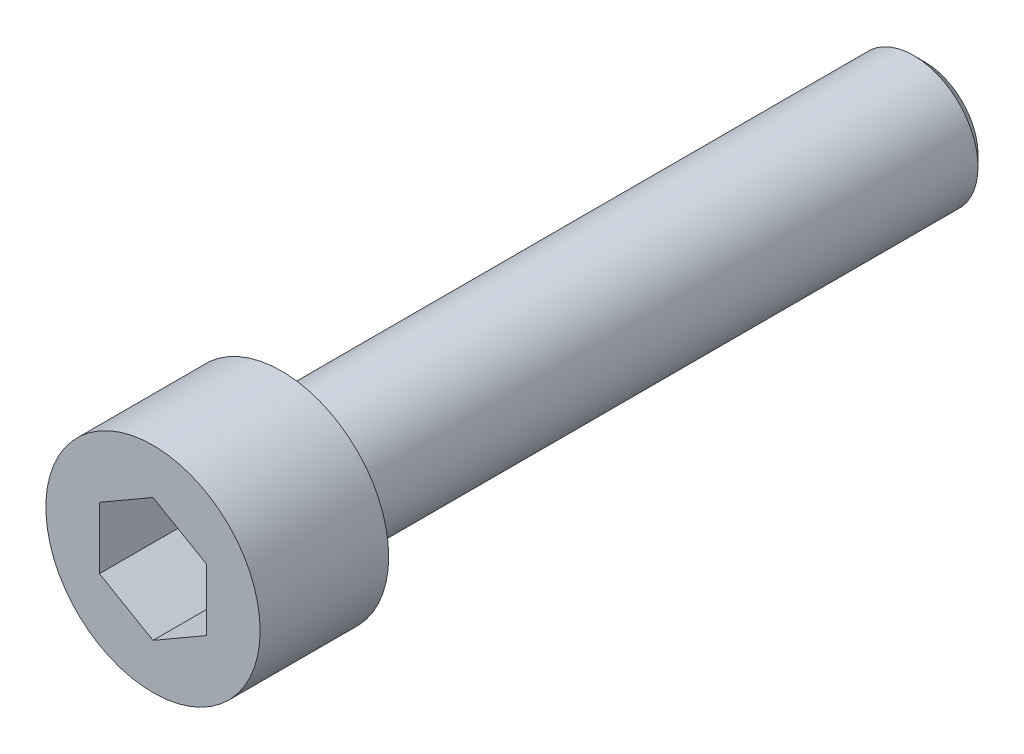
from build123d import *

# Parameters (mm, degrees)
SKETCH1_R           = 5
BASE_EXTRUDE_DEPTH  = 6
SKETCH2_R           = 3
BOSS_EXTRUDE1_DEPTH = 30
CUT_EXTRUDE1_DEPTH  = 5
CHAMFER1_SIZE       = 0.5


with BuildPart() as part:
    # Sketch1 → Base-Extrude (new body)
    with BuildSketch(Plane.XY):
        Circle(SKETCH1_R)
    extrude(amount=-BASE_EXTRUDE_DEPTH)

    # Sketch2 → Boss-Extrude1 (add)
    with BuildSketch(Plane(origin=(0, 0, -6), x_dir=(-1, 0, 0), z_dir=(0, 0, -1))):
        with Locations(Location((0, 0, 0), (0, 0, 180))):
            Circle(SKETCH2_R)
    extrude(amount=BOSS_EXTRUDE1_DEPTH)

    # Sketch3 → Cut-Extrude1 (cut)
    with BuildSketch(Plane.XY):
        Polygon((2.5, -1.443375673), (2.5, 1.443375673), (0, 2.886751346), (-2.5, 1.443375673), (-2.5, -1.443375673), (0, -2.886751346), align=None)
    extrude(amount=-CUT_EXTRUDE1_DEPTH, mode=Mode.SUBTRACT)

    # Chamfer1
    chamfer1_edges = [part.edges().sort_by_distance(p)[0] for p in [
        (-3, 0, -36),
    ]]
    chamfer(chamfer1_edges, length=CHAMFER1_SIZE)


solid = part.part
